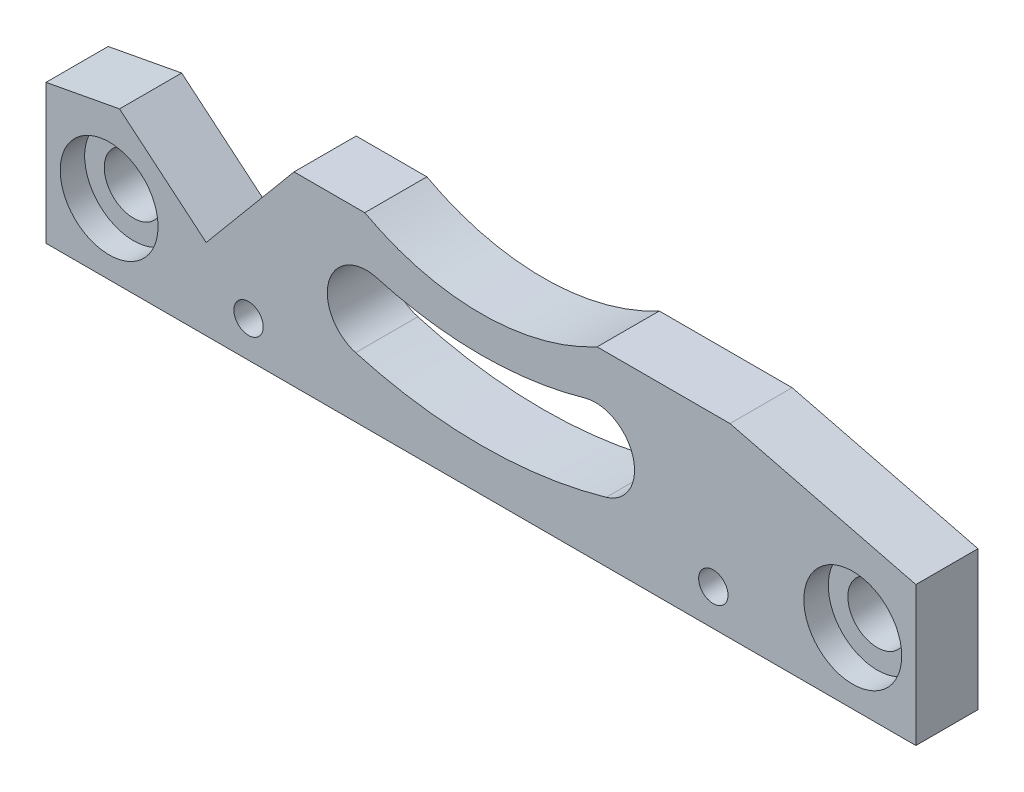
from build123d import *

# Parameters (mm, degrees)
BOSS_EXTRUDE1_DEPTH             = 3.175
CBORE_FOR_M6_SBHCS2_D           = 6
CBORE_FOR_M6_SBHCS2_CBORE_D     = 10
CBORE_FOR_M6_SBHCS2_CBORE_DEPTH = 2.5
F_3_0_3_DIAMETER_HOLE1_D        = 3
CUT_EXTRUDE1_REACH              = 50.756
CUT_EXTRUDE2_REACH              = 50.756


with BuildPart() as part:
    # Sketch1 → Boss-Extrude1 (new, symmetric)
    with BuildSketch(Plane.XY):
        Polygon((-44.45, 0), (44.45, 0), (44.45, 14.25), (25.45, 19), (-19.1, 19), (-28.077889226, 8.257676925), (-36.933177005, 15.658477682), (-44.45, 14.25), align=None)
    extrude(amount=BOSS_EXTRUDE1_DEPTH, both=True)

    # CBORE for M6 SBHCS2 (through all)
    with Locations(Plane.XY.offset(3.175)):
        with Locations((-38, 7.2)):
            cbore_for_m6_sbhcs2 = CounterBoreHole(CBORE_FOR_M6_SBHCS2_D / 2, CBORE_FOR_M6_SBHCS2_CBORE_D / 2, CBORE_FOR_M6_SBHCS2_CBORE_DEPTH)

    # Mirror1: CBORE for M6 SBHCS2 across plane
    add(cbore_for_m6_sbhcs2.mirror(Plane(origin=(0, 0, 0), x_dir=(0, 0, 1), z_dir=(1, 0, 0))), mode=Mode.SUBTRACT)

    # 3.0 _3_ Diameter Hole1 (through all)
    with Locations(Plane.XY.offset(3.175)):
        with Locations((-23.75, 3.7)):
            f_3_0_3_diameter_hole1 = Hole(F_3_0_3_DIAMETER_HOLE1_D / 2)

    # Mirror2: 3.0 _3_ Diameter Hole1 across plane
    add(f_3_0_3_diameter_hole1.mirror(Plane(origin=(0, 0, 0), x_dir=(0, 0, 1), z_dir=(1, 0, 0))), mode=Mode.SUBTRACT)

    # Sketch10 → Cut-Extrude1 (cut, up to next)
    with BuildSketch(Plane.XY.offset(3.175), mode=Mode.PRIVATE) as cut_extrude1_sk1:
        with BuildLine():
            ThreePointArc((-12.803355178, 6.149394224), (0, 4.35), (12.803355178, 6.149394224))
            ThreePointArc((12.803355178, 6.149394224), (15.545852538, 11.096990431), (10.598256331, 13.839487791))
            ThreePointArc((10.598256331, 13.839487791), (0, 12.35), (-10.598256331, 13.839487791))
            ThreePointArc((-10.598256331, 13.839487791), (-15.545852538, 11.096990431), (-12.803355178, 6.149394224))
        make_face()
    cut_extrude1_tool1 = extrude(cut_extrude1_sk1.sketch, amount=-CUT_EXTRUDE1_REACH, mode=Mode.PRIVATE) & part.part
    add(cut_extrude1_tool1.solids().sort_by_distance((0, 9.128947, 3.175))[0], mode=Mode.SUBTRACT)

    # Sketch11 → Cut-Extrude2 (cut, up to next)
    with BuildSketch(Plane.XY.offset(3.175), mode=Mode.PRIVATE) as cut_extrude2_sk1:
        with BuildLine():
            Line((11.874342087, 19), (-11.874342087, 19))
            ThreePointArc((-11.874342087, 19), (0, 16), (11.874342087, 19))
        make_face()
    cut_extrude2_tool1 = extrude(cut_extrude2_sk1.sketch, amount=-CUT_EXTRUDE2_REACH, mode=Mode.PRIVATE) & part.part
    add(cut_extrude2_tool1.solids().sort_by_distance((0, 17.793606, 3.175))[0], mode=Mode.SUBTRACT)


solid = part.part
